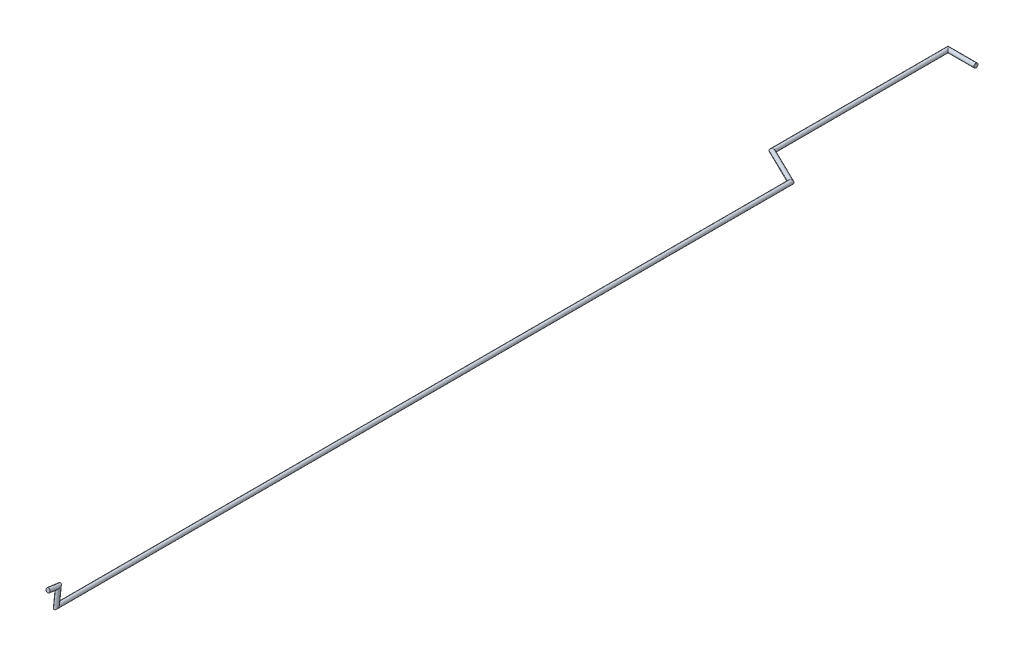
ISO-10303-21;
HEADER;
FILE_DESCRIPTION(('STEP AP214'),'2;1');
FILE_NAME('part.step','',(''),(''),'','','');
FILE_SCHEMA(('AUTOMOTIVE_DESIGN { 1 0 10303 214 1 1 1 1 }'));
ENDSEC;
DATA;
#1=APPLICATION_CONTEXT('core data for automotive mechanical design processes');
#2=APPLICATION_PROTOCOL_DEFINITION('international standard','automotive_design',2000,#1);
#3=PRODUCT_CONTEXT('',#1,'mechanical');
#4=PRODUCT('Part','Part','',(#3));
#5=PRODUCT_RELATED_PRODUCT_CATEGORY('part','',(#4));
#6=PRODUCT_DEFINITION_FORMATION('','',#4);
#7=PRODUCT_DEFINITION_CONTEXT('part definition',#1,'design');
#8=PRODUCT_DEFINITION('design','',#6,#7);
#9=PRODUCT_DEFINITION_SHAPE('','',#8);
#10=(LENGTH_UNIT() NAMED_UNIT(*) SI_UNIT(.MILLI.,.METRE.));
#11=(NAMED_UNIT(*) PLANE_ANGLE_UNIT() SI_UNIT($,.RADIAN.));
#12=(NAMED_UNIT(*) SI_UNIT($,.STERADIAN.) SOLID_ANGLE_UNIT());
#13=UNCERTAINTY_MEASURE_WITH_UNIT(LENGTH_MEASURE(1.E-05),#10,'distance_accuracy_value','');
#14=(GEOMETRIC_REPRESENTATION_CONTEXT(3) GLOBAL_UNCERTAINTY_ASSIGNED_CONTEXT((#13)) GLOBAL_UNIT_ASSIGNED_CONTEXT((#10,
#11,#12)) REPRESENTATION_CONTEXT('',''));
#15=CARTESIAN_POINT('',(0.,0.,0.));
#16=DIRECTION('',(0.,0.,1.));
#17=DIRECTION('',(1.,0.,0.));
#18=AXIS2_PLACEMENT_3D('',#15,#16,#17);
#19=CARTESIAN_POINT('',(2.39999999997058,4.74191589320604,268.640139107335));
#20=DIRECTION('',(1.56269673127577E-13,0.136681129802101,0.990615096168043));
#21=DIRECTION('',(0.,-0.990615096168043,0.136681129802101));
#22=AXIS2_PLACEMENT_3D('',#19,#20,#21);
#23=CYLINDRICAL_SURFACE('',#22,0.6);
#24=CARTESIAN_POINT('',(2.39999999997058,4.74191589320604,268.640139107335));
#25=DIRECTION('',(-4.19750753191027E-12,0.78932976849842,0.613969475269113));
#26=DIRECTION('',(-4.5301739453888E-12,0.613969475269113,-0.78932976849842));
#27=AXIS2_PLACEMENT_3D('',#24,#25,#26);
#28=ELLIPSE('',#27,0.837878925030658,0.6);
#29=CARTESIAN_POINT('',(2.39999999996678,5.25634797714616,267.978776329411));
#30=VERTEX_POINT('',#29);
#31=EDGE_CURVE('E41',#30,#30,#28,.F.);
#32=ORIENTED_EDGE('',*,*,#31,.F.);
#33=EDGE_LOOP('',(#32));
#34=FACE_BOUND('',#33,.T.);
#35=CARTESIAN_POINT('',(2.39999999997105,5.15195928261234,271.611984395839));
#36=DIRECTION('',(1.56269673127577E-13,0.136681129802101,0.990615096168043));
#37=DIRECTION('',(0.,-0.990615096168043,0.136681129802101));
#38=AXIS2_PLACEMENT_3D('',#35,#36,#37);
#39=CIRCLE('',#38,0.6);
#40=CARTESIAN_POINT('',(2.39999999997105,4.55759022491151,271.69399307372));
#41=VERTEX_POINT('',#40);
#42=EDGE_CURVE('E11',#41,#41,#39,.T.);
#43=ORIENTED_EDGE('',*,*,#42,.F.);
#44=EDGE_LOOP('',(#43));
#45=FACE_BOUND('',#44,.T.);
#46=ADVANCED_FACE('F35',(#34,#45),#23,.T.);
#47=CARTESIAN_POINT('',(2.40000000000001,0.,269.171192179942));
#48=DIRECTION('',(-6.16788887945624E-12,0.993787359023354,-0.111295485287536));
#49=DIRECTION('',(0.,0.111295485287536,0.993787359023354));
#50=AXIS2_PLACEMENT_3D('',#47,#48,#49);
#51=CYLINDRICAL_SURFACE('',#50,0.6);
#52=CARTESIAN_POINT('',(2.40000000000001,0.,269.171192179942));
#53=DIRECTION('',(-4.62641481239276E-12,0.745417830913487,0.666597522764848));
#54=DIRECTION('',(4.13718601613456E-12,-0.666597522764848,0.745417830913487));
#55=AXIS2_PLACEMENT_3D('',#52,#53,#54);
#56=ELLIPSE('',#55,0.90009335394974,0.6);
#57=CARTESIAN_POINT('',(2.40000000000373,-0.600000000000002,269.842137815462));
#58=VERTEX_POINT('',#57);
#59=EDGE_CURVE('E45',#58,#58,#56,.T.);
#60=ORIENTED_EDGE('',*,*,#59,.T.);
#61=EDGE_LOOP('',(#60));
#62=FACE_BOUND('',#61,.T.);
#63=ORIENTED_EDGE('',*,*,#31,.T.);
#64=EDGE_LOOP('',(#63));
#65=FACE_BOUND('',#64,.T.);
#66=ADVANCED_FACE('F88',(#62,#65),#51,.T.);
#67=CARTESIAN_POINT('',(2.40000000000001,0.,56.1211921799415));
#68=DIRECTION('',(0.,0.,1.));
#69=DIRECTION('',(1.,0.,0.));
#70=AXIS2_PLACEMENT_3D('',#67,#68,#69);
#71=CYLINDRICAL_SURFACE('',#70,0.6);
#72=CARTESIAN_POINT('',(2.40000000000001,0.,56.1211921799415));
#73=DIRECTION('',(0.529919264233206,0.,0.848048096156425));
#74=DIRECTION('',(0.848048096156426,0.,-0.529919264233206));
#75=AXIS2_PLACEMENT_3D('',#72,#73,#74);
#76=ELLIPSE('',#75,0.707507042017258,0.6);
#77=CARTESIAN_POINT('',(3.00000000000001,0.,55.7462705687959));
#78=VERTEX_POINT('',#77);
#79=EDGE_CURVE('E49',#78,#78,#76,.F.);
#80=ORIENTED_EDGE('',*,*,#79,.F.);
#81=EDGE_LOOP('',(#80));
#82=FACE_BOUND('',#81,.T.);
#83=ORIENTED_EDGE('',*,*,#59,.F.);
#84=EDGE_LOOP('',(#83));
#85=FACE_BOUND('',#84,.T.);
#86=ADVANCED_FACE('F82',(#82,#85),#71,.T.);
#87=CARTESIAN_POINT('',(-8.1,0.,51.));
#88=DIRECTION('',(0.898794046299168,0.,0.438371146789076));
#89=DIRECTION('',(0.438371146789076,0.,-0.898794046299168));
#90=AXIS2_PLACEMENT_3D('',#87,#88,#89);
#91=CYLINDRICAL_SURFACE('',#90,0.6);
#92=CARTESIAN_POINT('',(-8.1,0.,51.));
#93=DIRECTION('',(0.529919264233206,0.,0.848048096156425));
#94=DIRECTION('',(-0.848048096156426,0.,0.529919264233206));
#95=AXIS2_PLACEMENT_3D('',#92,#93,#94);
#96=ELLIPSE('',#95,0.707507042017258,0.6);
#97=CARTESIAN_POINT('',(-8.7,0.,51.3749216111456));
#98=VERTEX_POINT('',#97);
#99=EDGE_CURVE('E54',#98,#98,#96,.T.);
#100=ORIENTED_EDGE('',*,*,#99,.T.);
#101=EDGE_LOOP('',(#100));
#102=FACE_BOUND('',#101,.T.);
#103=ORIENTED_EDGE('',*,*,#79,.T.);
#104=EDGE_LOOP('',(#103));
#105=FACE_BOUND('',#104,.T.);
#106=ADVANCED_FACE('F76',(#102,#105),#91,.T.);
#107=CARTESIAN_POINT('',(-8.1,0.,0.));
#108=DIRECTION('',(0.,0.,1.));
#109=DIRECTION('',(1.,0.,0.));
#110=AXIS2_PLACEMENT_3D('',#107,#108,#109);
#111=CYLINDRICAL_SURFACE('',#110,0.6);
#112=CARTESIAN_POINT('',(-8.1,0.,0.));
#113=DIRECTION('',(-0.707106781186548,0.,0.707106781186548));
#114=DIRECTION('',(0.707106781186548,0.,0.707106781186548));
#115=AXIS2_PLACEMENT_3D('',#112,#113,#114);
#116=ELLIPSE('',#115,0.848528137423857,0.6);
#117=CARTESIAN_POINT('',(-7.5,0.,0.6));
#118=VERTEX_POINT('',#117);
#119=EDGE_CURVE('E57',#118,#118,#116,.F.);
#120=ORIENTED_EDGE('',*,*,#119,.F.);
#121=EDGE_LOOP('',(#120));
#122=FACE_BOUND('',#121,.T.);
#123=ORIENTED_EDGE('',*,*,#99,.F.);
#124=EDGE_LOOP('',(#123));
#125=FACE_BOUND('',#124,.T.);
#126=ADVANCED_FACE('F73',(#122,#125),#111,.T.);
#127=CARTESIAN_POINT('',(0.,0.,0.));
#128=DIRECTION('',(1.,0.,0.));
#129=DIRECTION('',(0.,0.,-1.));
#130=AXIS2_PLACEMENT_3D('',#127,#128,#129);
#131=PLANE('',#130);
#132=CARTESIAN_POINT('',(0.,0.,0.));
#133=DIRECTION('',(1.,0.,0.));
#134=DIRECTION('',(0.,0.,-1.));
#135=AXIS2_PLACEMENT_3D('',#132,#133,#134);
#136=CIRCLE('',#135,0.6);
#137=CARTESIAN_POINT('',(0.,0.,-0.6));
#138=VERTEX_POINT('',#137);
#139=EDGE_CURVE('E60',#138,#138,#136,.T.);
#140=ORIENTED_EDGE('',*,*,#139,.T.);
#141=EDGE_LOOP('',(#140));
#142=FACE_BOUND('',#141,.T.);
#143=ADVANCED_FACE('F64',(#142),#131,.T.);
#144=CARTESIAN_POINT('',(-9.79705627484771,0.,0.));
#145=DIRECTION('',(1.,0.,0.));
#146=DIRECTION('',(0.,0.,-1.));
#147=AXIS2_PLACEMENT_3D('',#144,#145,#146);
#148=CYLINDRICAL_SURFACE('',#147,0.6);
#149=ORIENTED_EDGE('',*,*,#139,.F.);
#150=EDGE_LOOP('',(#149));
#151=FACE_BOUND('',#150,.T.);
#152=ORIENTED_EDGE('',*,*,#119,.T.);
#153=EDGE_LOOP('',(#152));
#154=FACE_BOUND('',#153,.T.);
#155=ADVANCED_FACE('F66',(#151,#154),#148,.T.);
#156=CARTESIAN_POINT('',(2.39999999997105,5.15195928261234,271.611984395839));
#157=DIRECTION('',(1.56269673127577E-13,0.136681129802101,0.990615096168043));
#158=DIRECTION('',(0.,-0.990615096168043,0.136681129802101));
#159=AXIS2_PLACEMENT_3D('',#156,#157,#158);
#160=PLANE('',#159);
#161=ORIENTED_EDGE('',*,*,#42,.T.);
#162=EDGE_LOOP('',(#161));
#163=FACE_BOUND('',#162,.T.);
#164=ADVANCED_FACE('F69',(#163),#160,.T.);
#165=CLOSED_SHELL('',(#46,#66,#86,#106,#126,#143,#155,#164));
#166=MANIFOLD_SOLID_BREP('B2',#165);
#167=ADVANCED_BREP_SHAPE_REPRESENTATION('',(#18,#166),#14);
#168=SHAPE_DEFINITION_REPRESENTATION(#9,#167);
ENDSEC;
END-ISO-10303-21;
